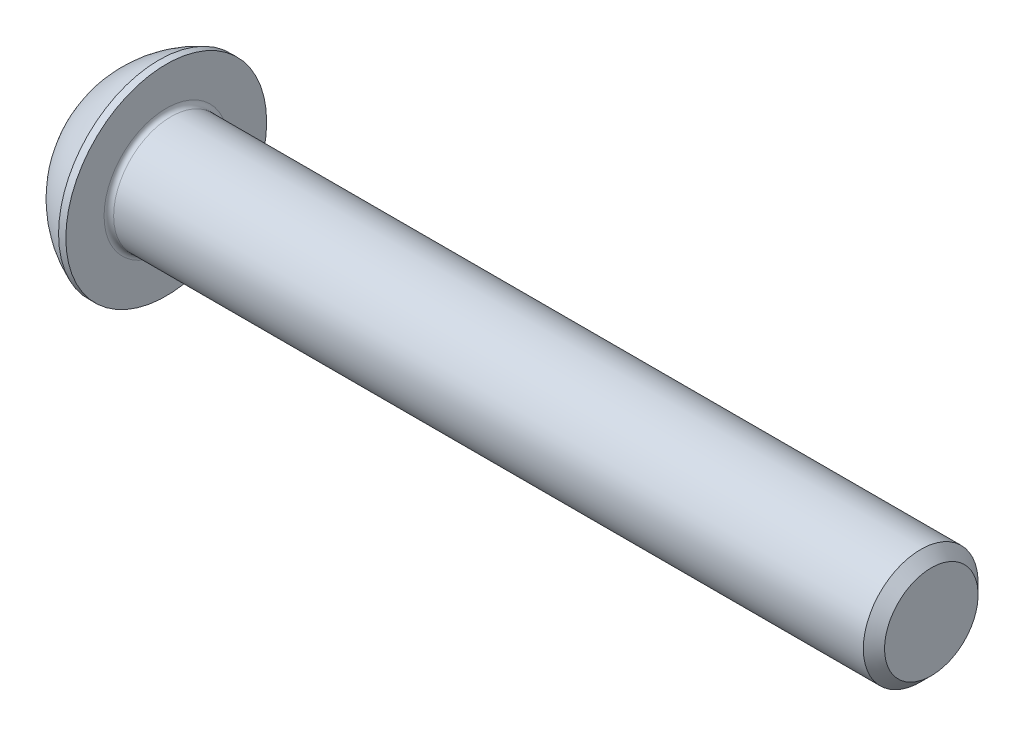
ISO-10303-21;
HEADER;
FILE_DESCRIPTION(('STEP AP214'),'2;1');
FILE_NAME('part.step','',(''),(''),'','','');
FILE_SCHEMA(('AUTOMOTIVE_DESIGN { 1 0 10303 214 1 1 1 1 }'));
ENDSEC;
DATA;
#1=APPLICATION_CONTEXT('core data for automotive mechanical design processes');
#2=APPLICATION_PROTOCOL_DEFINITION('international standard','automotive_design',2000,#1);
#3=PRODUCT_CONTEXT('',#1,'mechanical');
#4=PRODUCT('Part','Part','',(#3));
#5=PRODUCT_RELATED_PRODUCT_CATEGORY('part','',(#4));
#6=PRODUCT_DEFINITION_FORMATION('','',#4);
#7=PRODUCT_DEFINITION_CONTEXT('part definition',#1,'design');
#8=PRODUCT_DEFINITION('design','',#6,#7);
#9=PRODUCT_DEFINITION_SHAPE('','',#8);
#10=(LENGTH_UNIT() NAMED_UNIT(*) SI_UNIT(.MILLI.,.METRE.));
#11=(NAMED_UNIT(*) PLANE_ANGLE_UNIT() SI_UNIT($,.RADIAN.));
#12=(NAMED_UNIT(*) SI_UNIT($,.STERADIAN.) SOLID_ANGLE_UNIT());
#13=UNCERTAINTY_MEASURE_WITH_UNIT(LENGTH_MEASURE(1.E-05),#10,'distance_accuracy_value','');
#14=(GEOMETRIC_REPRESENTATION_CONTEXT(3) GLOBAL_UNCERTAINTY_ASSIGNED_CONTEXT((#13)) GLOBAL_UNIT_ASSIGNED_CONTEXT((#10,
#11,#12)) REPRESENTATION_CONTEXT('',''));
#15=CARTESIAN_POINT('',(0.,0.,0.));
#16=DIRECTION('',(0.,0.,1.));
#17=DIRECTION('',(1.,0.,0.));
#18=AXIS2_PLACEMENT_3D('',#15,#16,#17);
#19=CARTESIAN_POINT('',(0.,0.,0.));
#20=DIRECTION('',(-1.,0.,0.));
#21=DIRECTION('',(0.,0.,1.));
#22=AXIS2_PLACEMENT_3D('',#19,#20,#21);
#23=PLANE('',#22);
#24=CARTESIAN_POINT('',(0.,0.,0.));
#25=DIRECTION('',(-1.,0.,0.));
#26=DIRECTION('',(0.,0.,1.));
#27=AXIS2_PLACEMENT_3D('',#24,#25,#26);
#28=CIRCLE('',#27,2.625);
#29=CARTESIAN_POINT('',(0.,2.625,0.));
#30=VERTEX_POINT('',#29);
#31=EDGE_CURVE('E157',#30,#30,#28,.T.);
#32=ORIENTED_EDGE('',*,*,#31,.T.);
#33=EDGE_LOOP('',(#32));
#34=FACE_BOUND('',#33,.T.);
#35=DIRECTION('',(0.,-1.,0.));
#36=VECTOR('',#35,1.);
#37=CARTESIAN_POINT('',(0.,-1.15470053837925,2.));
#38=LINE('',#37,#36);
#39=CARTESIAN_POINT('',(0.,1.15470053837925,2.));
#40=VERTEX_POINT('',#39);
#41=CARTESIAN_POINT('',(0.,-1.15470053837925,2.));
#42=VERTEX_POINT('',#41);
#43=EDGE_CURVE('E52',#40,#42,#38,.T.);
#44=ORIENTED_EDGE('',*,*,#43,.T.);
#45=DIRECTION('',(0.,-0.5,-0.866025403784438));
#46=VECTOR('',#45,1.);
#47=CARTESIAN_POINT('',(0.,-2.3094010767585,0.));
#48=LINE('',#47,#46);
#49=CARTESIAN_POINT('',(0.,-2.3094010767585,0.));
#50=VERTEX_POINT('',#49);
#51=EDGE_CURVE('E277',#42,#50,#48,.T.);
#52=ORIENTED_EDGE('',*,*,#51,.T.);
#53=DIRECTION('',(0.,0.5,-0.866025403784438));
#54=VECTOR('',#53,1.);
#55=CARTESIAN_POINT('',(0.,-1.15470053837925,-2.));
#56=LINE('',#55,#54);
#57=CARTESIAN_POINT('',(0.,-1.15470053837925,-2.));
#58=VERTEX_POINT('',#57);
#59=EDGE_CURVE('E132',#50,#58,#56,.T.);
#60=ORIENTED_EDGE('',*,*,#59,.T.);
#61=DIRECTION('',(0.,1.,0.));
#62=VECTOR('',#61,1.);
#63=CARTESIAN_POINT('',(0.,1.15470053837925,-2.));
#64=LINE('',#63,#62);
#65=CARTESIAN_POINT('',(0.,1.15470053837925,-2.));
#66=VERTEX_POINT('',#65);
#67=EDGE_CURVE('E280',#58,#66,#64,.T.);
#68=ORIENTED_EDGE('',*,*,#67,.T.);
#69=DIRECTION('',(0.,0.5,0.866025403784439));
#70=VECTOR('',#69,1.);
#71=CARTESIAN_POINT('',(0.,2.3094010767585,0.));
#72=LINE('',#71,#70);
#73=CARTESIAN_POINT('',(0.,2.3094010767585,0.));
#74=VERTEX_POINT('',#73);
#75=EDGE_CURVE('E282',#66,#74,#72,.T.);
#76=ORIENTED_EDGE('',*,*,#75,.T.);
#77=DIRECTION('',(0.,-0.5,0.866025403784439));
#78=VECTOR('',#77,1.);
#79=CARTESIAN_POINT('',(0.,1.15470053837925,2.));
#80=LINE('',#79,#78);
#81=EDGE_CURVE('E284',#74,#40,#80,.T.);
#82=ORIENTED_EDGE('',*,*,#81,.T.);
#83=EDGE_LOOP('',(#44,#52,#60,#68,#76,#82));
#84=FACE_BOUND('',#83,.T.);
#85=ADVANCED_FACE('F37',(#34,#84),#23,.T.);
#86=CARTESIAN_POINT('',(4.99970462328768,0.,0.));
#87=DIRECTION('',(-1.,0.,0.));
#88=DIRECTION('',(0.,1.,0.));
#89=AXIS2_PLACEMENT_3D('',#86,#87,#88);
#90=SPHERICAL_SURFACE('',#89,5.64691697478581);
#91=CARTESIAN_POINT('',(2.92,0.,0.));
#92=DIRECTION('',(-1.,0.,0.));
#93=DIRECTION('',(0.,0.,1.));
#94=AXIS2_PLACEMENT_3D('',#91,#92,#93);
#95=CIRCLE('',#94,5.25);
#96=CARTESIAN_POINT('',(2.92,5.25,0.));
#97=VERTEX_POINT('',#96);
#98=EDGE_CURVE('E154',#97,#97,#95,.T.);
#99=CARTESIAN_POINT('',(2.92,5.25,0.));
#100=CARTESIAN_POINT('',(2.88116333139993,5.23461555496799,0.));
#101=CARTESIAN_POINT('',(2.84249743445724,5.21880002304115,0.));
#102=CARTESIAN_POINT('',(2.76552608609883,5.18631490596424,0.));
#103=CARTESIAN_POINT('',(2.72722063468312,5.16964532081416,0.));
#104=CARTESIAN_POINT('',(2.65098907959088,5.13546021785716,0.));
#105=CARTESIAN_POINT('',(2.61306297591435,5.11794470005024,0.));
#106=CARTESIAN_POINT('',(2.5376087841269,5.08207638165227,0.));
#107=CARTESIAN_POINT('',(2.50008069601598,5.06372358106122,0.));
#108=CARTESIAN_POINT('',(2.42544101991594,5.02618972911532,0.));
#109=CARTESIAN_POINT('',(2.38832943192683,5.00700867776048,0.));
#110=CARTESIAN_POINT('',(2.31454103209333,4.9678277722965,0.));
#111=CARTESIAN_POINT('',(2.27786422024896,4.94782791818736,0.));
#112=CARTESIAN_POINT('',(2.204963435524,4.90701925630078,0.));
#113=CARTESIAN_POINT('',(2.16873946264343,4.88621044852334,0.));
#114=CARTESIAN_POINT('',(2.09676219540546,4.84379412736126,0.));
#115=CARTESIAN_POINT('',(2.06100890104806,4.82218661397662,0.));
#116=CARTESIAN_POINT('',(1.9899905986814,4.77818352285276,0.));
#117=CARTESIAN_POINT('',(1.95472559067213,4.75578794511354,0.));
#118=CARTESIAN_POINT('',(1.88470122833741,4.7102197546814,0.));
#119=CARTESIAN_POINT('',(1.84994187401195,4.68704714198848,0.));
#120=CARTESIAN_POINT('',(1.78094593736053,4.63993629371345,0.));
#121=CARTESIAN_POINT('',(1.74670935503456,4.61599805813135,0.));
#122=CARTESIAN_POINT('',(1.67877582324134,4.56736775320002,0.));
#123=CARTESIAN_POINT('',(1.6450788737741,4.54267568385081,0.));
#124=CARTESIAN_POINT('',(1.57824120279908,4.4925498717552,0.));
#125=CARTESIAN_POINT('',(1.54510048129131,4.46711612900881,0.));
#126=CARTESIAN_POINT('',(1.4793915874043,4.4155194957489,0.));
#127=CARTESIAN_POINT('',(1.44682341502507,4.38935660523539,0.));
#128=CARTESIAN_POINT('',(1.3822756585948,4.33631456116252,0.));
#129=CARTESIAN_POINT('',(1.35029607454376,4.30943540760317,0.));
#130=CARTESIAN_POINT('',(1.28694124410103,4.2549740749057,0.));
#131=CARTESIAN_POINT('',(1.25556599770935,4.22739189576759,0.));
#132=CARTESIAN_POINT('',(1.19343529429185,4.17153809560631,0.));
#133=CARTESIAN_POINT('',(1.16267983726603,4.14326647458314,0.));
#134=CARTESIAN_POINT('',(1.10180385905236,4.0860477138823,0.));
#135=CARTESIAN_POINT('',(1.07168333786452,4.05710057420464,0.));
#136=CARTESIAN_POINT('',(1.01209206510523,3.99854503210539,0.));
#137=CARTESIAN_POINT('',(0.982621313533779,3.96893662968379,0.));
#138=CARTESIAN_POINT('',(0.924344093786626,3.90907314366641,0.));
#139=CARTESIAN_POINT('',(0.895537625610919,3.87881806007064,0.));
#140=CARTESIAN_POINT('',(0.838603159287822,3.8176761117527,0.));
#141=CARTESIAN_POINT('',(0.810475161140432,3.78678924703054,0.));
#142=CARTESIAN_POINT('',(0.754911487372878,3.72439894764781,0.));
#143=CARTESIAN_POINT('',(0.727475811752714,3.69289551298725,0.));
#144=CARTESIAN_POINT('',(0.673310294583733,3.62928758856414,0.));
#145=CARTESIAN_POINT('',(0.646580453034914,3.59718309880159,0.));
#146=CARTESIAN_POINT('',(0.593839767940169,3.53238887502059,0.));
#147=CARTESIAN_POINT('',(0.567828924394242,3.49969914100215,0.));
#148=CARTESIAN_POINT('',(0.516539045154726,3.43375052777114,0.));
#149=CARTESIAN_POINT('',(0.491260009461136,3.40049164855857,0.));
#150=CARTESIAN_POINT('',(0.441446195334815,3.33342112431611,0.));
#151=CARTESIAN_POINT('',(0.416911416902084,3.29960947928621,0.));
#152=CARTESIAN_POINT('',(0.368598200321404,3.23145007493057,0.));
#153=CARTESIAN_POINT('',(0.344819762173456,3.19710231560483,0.));
#154=CARTESIAN_POINT('',(0.298030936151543,3.12788759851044,0.));
#155=CARTESIAN_POINT('',(0.275020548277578,3.09302064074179,0.));
#156=CARTESIAN_POINT('',(0.229779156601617,3.02278469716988,0.));
#157=CARTESIAN_POINT('',(0.207548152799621,2.98741571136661,0.));
#158=CARTESIAN_POINT('',(0.163876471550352,2.91619313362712,0.));
#159=CARTESIAN_POINT('',(0.142435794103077,2.8803395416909,0.));
#160=CARTESIAN_POINT('',(0.100355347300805,2.80816539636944,0.));
#161=CARTESIAN_POINT('',(0.0797155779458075,2.7718448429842,0.));
#162=CARTESIAN_POINT('',(0.0392470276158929,2.69875470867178,0.));
#163=CARTESIAN_POINT('',(0.0194182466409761,2.66198512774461,0.));
#164=CARTESIAN_POINT('',(0.,2.625,0.));
#165=B_SPLINE_CURVE_WITH_KNOTS('',3,(#99,#100,#101,#102,#103,#104,#105,#106,#107,#108,#109,#110,
#111,#112,#113,#114,#115,#116,#117,#118,#119,#120,#121,#122,#123,#124,#125,#126,#127,#128,#129,
#130,#131,#132,#133,#134,#135,#136,#137,#138,#139,#140,#141,#142,#143,#144,#145,#146,#147,#148,
#149,#150,#151,#152,#153,#154,#155,#156,#157,#158,#159,#160,#161,#162,#163,#164),.UNSPECIFIED.,
.F.,.F.,(4,2,2,2,2,2,2,2,2,2,2,2,2,2,2,2,2,2,2,2,2,2,2,2,2,2,2,2,2,2,2,2,4),(0.,
0.12531586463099,0.25063172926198,0.37594759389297,0.50126345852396,0.62657932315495,
0.75189518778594,0.877211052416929,1.00252691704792,1.12784278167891,1.2531586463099,
1.37847451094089,1.50379037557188,1.62910624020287,1.75442210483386,1.87973796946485,
2.00505383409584,2.13036969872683,2.25568556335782,2.38100142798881,2.5063172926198,
2.63163315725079,2.75694902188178,2.88226488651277,3.00758075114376,3.13289661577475,
3.25821248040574,3.38352834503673,3.50884420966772,3.63416007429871,3.7594759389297,
3.88479180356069,4.01010766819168),.UNSPECIFIED.);
#166=EDGE_CURVE('BSEAM178',#97,#30,#165,.T.);
#167=ORIENTED_EDGE('',*,*,#98,.T.);
#168=ORIENTED_EDGE('',*,*,#31,.F.);
#169=ORIENTED_EDGE('',*,*,#166,.T.);
#170=ORIENTED_EDGE('',*,*,#166,.F.);
#171=EDGE_LOOP('',(#167,#169,#168,#170));
#172=FACE_BOUND('',#171,.T.);
#173=ADVANCED_FACE('F178',(#172),#90,.T.);
#174=CARTESIAN_POINT('',(0.,0.,0.));
#175=DIRECTION('',(-1.,0.,0.));
#176=DIRECTION('',(0.,0.,1.));
#177=AXIS2_PLACEMENT_3D('',#174,#175,#176);
#178=CYLINDRICAL_SURFACE('',#177,5.25);
#179=ORIENTED_EDGE('',*,*,#98,.F.);
#180=EDGE_LOOP('',(#179));
#181=FACE_BOUND('',#180,.T.);
#182=CARTESIAN_POINT('',(3.3,0.,0.));
#183=DIRECTION('',(-1.,0.,0.));
#184=DIRECTION('',(0.,0.,1.));
#185=AXIS2_PLACEMENT_3D('',#182,#183,#184);
#186=CIRCLE('',#185,5.25);
#187=CARTESIAN_POINT('',(3.3,0.,5.25));
#188=VERTEX_POINT('',#187);
#189=EDGE_CURVE('E151',#188,#188,#186,.T.);
#190=ORIENTED_EDGE('',*,*,#189,.T.);
#191=EDGE_LOOP('',(#190));
#192=FACE_BOUND('',#191,.T.);
#193=ADVANCED_FACE('F183',(#181,#192),#178,.T.);
#194=CARTESIAN_POINT('',(3.3,3.,0.));
#195=DIRECTION('',(-1.,0.,0.));
#196=DIRECTION('',(0.,0.,1.));
#197=AXIS2_PLACEMENT_3D('',#194,#195,#196);
#198=PLANE('',#197);
#199=CARTESIAN_POINT('',(3.3,0.,0.));
#200=DIRECTION('',(-1.,0.,0.));
#201=DIRECTION('',(0.,0.,1.));
#202=AXIS2_PLACEMENT_3D('',#199,#200,#201);
#203=CIRCLE('',#202,3.25);
#204=CARTESIAN_POINT('',(3.3,0.,3.25));
#205=VERTEX_POINT('',#204);
#206=EDGE_CURVE('E45',#205,#205,#203,.T.);
#207=ORIENTED_EDGE('',*,*,#206,.T.);
#208=EDGE_LOOP('',(#207));
#209=FACE_BOUND('',#208,.T.);
#210=ORIENTED_EDGE('',*,*,#189,.F.);
#211=EDGE_LOOP('',(#210));
#212=FACE_BOUND('',#211,.T.);
#213=ADVANCED_FACE('F162',(#209,#212),#198,.F.);
#214=CARTESIAN_POINT('',(0.,0.,0.));
#215=DIRECTION('',(-1.,0.,0.));
#216=DIRECTION('',(0.,0.,1.));
#217=AXIS2_PLACEMENT_3D('',#214,#215,#216);
#218=CYLINDRICAL_SURFACE('',#217,3.);
#219=CARTESIAN_POINT('',(3.55,0.,0.));
#220=DIRECTION('',(-1.,0.,0.));
#221=DIRECTION('',(0.,0.,1.));
#222=AXIS2_PLACEMENT_3D('',#219,#220,#221);
#223=CIRCLE('',#222,3.);
#224=CARTESIAN_POINT('',(3.55,0.,3.));
#225=VERTEX_POINT('',#224);
#226=EDGE_CURVE('E11',#225,#225,#223,.F.);
#227=ORIENTED_EDGE('',*,*,#226,.T.);
#228=EDGE_LOOP('',(#227));
#229=FACE_BOUND('',#228,.T.);
#230=CARTESIAN_POINT('',(42.7455,0.,0.));
#231=DIRECTION('',(-1.,0.,0.));
#232=DIRECTION('',(0.,0.,1.));
#233=AXIS2_PLACEMENT_3D('',#230,#231,#232);
#234=CIRCLE('',#233,3.);
#235=CARTESIAN_POINT('',(42.7455,0.,3.));
#236=VERTEX_POINT('',#235);
#237=EDGE_CURVE('E148',#236,#236,#234,.T.);
#238=ORIENTED_EDGE('',*,*,#237,.T.);
#239=EDGE_LOOP('',(#238));
#240=FACE_BOUND('',#239,.T.);
#241=ADVANCED_FACE('F192',(#229,#240),#218,.T.);
#242=CARTESIAN_POINT('',(43.3,0.,0.));
#243=DIRECTION('',(-1.,0.,0.));
#244=DIRECTION('',(0.,0.,1.));
#245=AXIS2_PLACEMENT_3D('',#242,#243,#244);
#246=CONICAL_SURFACE('',#245,2.4455,0.785398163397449);
#247=ORIENTED_EDGE('',*,*,#237,.F.);
#248=EDGE_LOOP('',(#247));
#249=FACE_BOUND('',#248,.T.);
#250=CARTESIAN_POINT('',(43.3,0.,0.));
#251=DIRECTION('',(-1.,0.,0.));
#252=DIRECTION('',(0.,0.,1.));
#253=AXIS2_PLACEMENT_3D('',#250,#251,#252);
#254=CIRCLE('',#253,2.4455);
#255=CARTESIAN_POINT('',(43.3,0.,2.4455));
#256=VERTEX_POINT('',#255);
#257=EDGE_CURVE('E144',#256,#256,#254,.T.);
#258=ORIENTED_EDGE('',*,*,#257,.T.);
#259=EDGE_LOOP('',(#258));
#260=FACE_BOUND('',#259,.T.);
#261=ADVANCED_FACE('F173',(#249,#260),#246,.T.);
#262=CARTESIAN_POINT('',(43.3,0.,0.));
#263=DIRECTION('',(-1.,0.,0.));
#264=DIRECTION('',(0.,0.,1.));
#265=AXIS2_PLACEMENT_3D('',#262,#263,#264);
#266=PLANE('',#265);
#267=ORIENTED_EDGE('',*,*,#257,.F.);
#268=EDGE_LOOP('',(#267));
#269=FACE_BOUND('',#268,.T.);
#270=ADVANCED_FACE('F166',(#269),#266,.F.);
#271=CARTESIAN_POINT('',(3.55,0.,0.));
#272=DIRECTION('',(-1.,0.,0.));
#273=DIRECTION('',(0.,0.,1.));
#274=AXIS2_PLACEMENT_3D('',#271,#272,#273);
#275=TOROIDAL_SURFACE('',#274,3.25,0.25);
#276=ORIENTED_EDGE('',*,*,#226,.F.);
#277=EDGE_LOOP('',(#276));
#278=FACE_BOUND('',#277,.T.);
#279=ORIENTED_EDGE('',*,*,#206,.F.);
#280=EDGE_LOOP('',(#279));
#281=FACE_BOUND('',#280,.T.);
#282=ADVANCED_FACE('F39',(#278,#281),#275,.F.);
#283=CARTESIAN_POINT('',(2.08,-2.3094010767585,0.));
#284=DIRECTION('',(0.,0.866025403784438,-0.500000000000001));
#285=DIRECTION('',(0.,0.500000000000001,0.866025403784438));
#286=AXIS2_PLACEMENT_3D('',#283,#284,#285);
#287=PLANE('',#286);
#288=DIRECTION('',(0.,-0.5,-0.866025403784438));
#289=VECTOR('',#288,1.);
#290=CARTESIAN_POINT('',(2.08,-2.3094010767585,0.));
#291=LINE('',#290,#289);
#292=CARTESIAN_POINT('',(2.08,-1.15470053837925,2.));
#293=VERTEX_POINT('',#292);
#294=CARTESIAN_POINT('',(2.08,-1.73205080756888,1.));
#295=VERTEX_POINT('',#294);
#296=EDGE_CURVE('E118',#293,#295,#291,.T.);
#297=ORIENTED_EDGE('',*,*,#296,.T.);
#298=CARTESIAN_POINT('',(2.08,-2.3094010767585,0.));
#299=VERTEX_POINT('',#298);
#300=EDGE_CURVE('E113',#295,#299,#291,.T.);
#301=ORIENTED_EDGE('',*,*,#300,.T.);
#302=DIRECTION('',(-1.,0.,0.));
#303=VECTOR('',#302,1.);
#304=CARTESIAN_POINT('',(2.08,-2.3094010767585,0.));
#305=LINE('',#304,#303);
#306=EDGE_CURVE('E115',#299,#50,#305,.T.);
#307=ORIENTED_EDGE('',*,*,#306,.T.);
#308=ORIENTED_EDGE('',*,*,#51,.F.);
#309=DIRECTION('',(-1.,0.,0.));
#310=VECTOR('',#309,1.);
#311=CARTESIAN_POINT('',(2.08,-1.15470053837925,2.));
#312=LINE('',#311,#310);
#313=EDGE_CURVE('E273',#293,#42,#312,.T.);
#314=ORIENTED_EDGE('',*,*,#313,.F.);
#315=EDGE_LOOP('',(#297,#301,#307,#308,#314));
#316=FACE_BOUND('',#315,.T.);
#317=ADVANCED_FACE('F114',(#316),#287,.T.);
#318=CARTESIAN_POINT('',(2.08,-1.15470053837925,-2.));
#319=DIRECTION('',(0.,0.866025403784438,0.5));
#320=DIRECTION('',(0.,-0.5,0.866025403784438));
#321=AXIS2_PLACEMENT_3D('',#318,#319,#320);
#322=PLANE('',#321);
#323=DIRECTION('',(0.,0.5,-0.866025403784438));
#324=VECTOR('',#323,1.);
#325=CARTESIAN_POINT('',(2.08,-1.15470053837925,-2.));
#326=LINE('',#325,#324);
#327=CARTESIAN_POINT('',(2.08,-1.73205080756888,-1.));
#328=VERTEX_POINT('',#327);
#329=EDGE_CURVE('E60',#299,#328,#326,.T.);
#330=ORIENTED_EDGE('',*,*,#329,.T.);
#331=CARTESIAN_POINT('',(2.08,-1.15470053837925,-2.));
#332=VERTEX_POINT('',#331);
#333=EDGE_CURVE('E127',#328,#332,#326,.T.);
#334=ORIENTED_EDGE('',*,*,#333,.T.);
#335=DIRECTION('',(-1.,0.,0.));
#336=VECTOR('',#335,1.);
#337=CARTESIAN_POINT('',(2.08,-1.15470053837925,-2.));
#338=LINE('',#337,#336);
#339=EDGE_CURVE('E134',#332,#58,#338,.T.);
#340=ORIENTED_EDGE('',*,*,#339,.T.);
#341=ORIENTED_EDGE('',*,*,#59,.F.);
#342=ORIENTED_EDGE('',*,*,#306,.F.);
#343=EDGE_LOOP('',(#330,#334,#340,#341,#342));
#344=FACE_BOUND('',#343,.T.);
#345=ADVANCED_FACE('F130',(#344),#322,.T.);
#346=CARTESIAN_POINT('',(2.08,1.15470053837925,-2.));
#347=DIRECTION('',(0.,0.,1.));
#348=DIRECTION('',(1.,0.,0.));
#349=AXIS2_PLACEMENT_3D('',#346,#347,#348);
#350=PLANE('',#349);
#351=DIRECTION('',(0.,1.,0.));
#352=VECTOR('',#351,1.);
#353=CARTESIAN_POINT('',(2.08,1.15470053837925,-2.));
#354=LINE('',#353,#352);
#355=CARTESIAN_POINT('',(2.08,0.,-2.));
#356=VERTEX_POINT('',#355);
#357=EDGE_CURVE('E254',#332,#356,#354,.T.);
#358=ORIENTED_EDGE('',*,*,#357,.T.);
#359=CARTESIAN_POINT('',(2.08,1.15470053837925,-2.));
#360=VERTEX_POINT('',#359);
#361=EDGE_CURVE('E126',#356,#360,#354,.T.);
#362=ORIENTED_EDGE('',*,*,#361,.T.);
#363=DIRECTION('',(-1.,0.,0.));
#364=VECTOR('',#363,1.);
#365=CARTESIAN_POINT('',(2.08,1.15470053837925,-2.));
#366=LINE('',#365,#364);
#367=EDGE_CURVE('E139',#360,#66,#366,.T.);
#368=ORIENTED_EDGE('',*,*,#367,.T.);
#369=ORIENTED_EDGE('',*,*,#67,.F.);
#370=ORIENTED_EDGE('',*,*,#339,.F.);
#371=EDGE_LOOP('',(#358,#362,#368,#369,#370));
#372=FACE_BOUND('',#371,.T.);
#373=ADVANCED_FACE('F206',(#372),#350,.T.);
#374=CARTESIAN_POINT('',(2.08,2.3094010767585,0.));
#375=DIRECTION('',(0.,-0.866025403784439,0.5));
#376=DIRECTION('',(0.,-0.5,-0.866025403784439));
#377=AXIS2_PLACEMENT_3D('',#374,#375,#376);
#378=PLANE('',#377);
#379=DIRECTION('',(0.,0.5,0.866025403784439));
#380=VECTOR('',#379,1.);
#381=CARTESIAN_POINT('',(2.08,2.3094010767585,0.));
#382=LINE('',#381,#380);
#383=CARTESIAN_POINT('',(2.08,1.73205080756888,-0.999999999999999));
#384=VERTEX_POINT('',#383);
#385=EDGE_CURVE('E243',#360,#384,#382,.T.);
#386=ORIENTED_EDGE('',*,*,#385,.T.);
#387=CARTESIAN_POINT('',(2.08,2.3094010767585,0.));
#388=VERTEX_POINT('',#387);
#389=EDGE_CURVE('E248',#384,#388,#382,.T.);
#390=ORIENTED_EDGE('',*,*,#389,.T.);
#391=DIRECTION('',(-1.,0.,0.));
#392=VECTOR('',#391,1.);
#393=CARTESIAN_POINT('',(2.08,2.3094010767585,0.));
#394=LINE('',#393,#392);
#395=EDGE_CURVE('E288',#388,#74,#394,.T.);
#396=ORIENTED_EDGE('',*,*,#395,.T.);
#397=ORIENTED_EDGE('',*,*,#75,.F.);
#398=ORIENTED_EDGE('',*,*,#367,.F.);
#399=EDGE_LOOP('',(#386,#390,#396,#397,#398));
#400=FACE_BOUND('',#399,.T.);
#401=ADVANCED_FACE('F209',(#400),#378,.T.);
#402=CARTESIAN_POINT('',(2.08,1.15470053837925,2.));
#403=DIRECTION('',(0.,-0.866025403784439,-0.5));
#404=DIRECTION('',(0.,0.5,-0.866025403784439));
#405=AXIS2_PLACEMENT_3D('',#402,#403,#404);
#406=PLANE('',#405);
#407=DIRECTION('',(0.,-0.5,0.866025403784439));
#408=VECTOR('',#407,1.);
#409=CARTESIAN_POINT('',(2.08,1.15470053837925,2.));
#410=LINE('',#409,#408);
#411=CARTESIAN_POINT('',(2.08,1.73205080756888,0.999999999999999));
#412=VERTEX_POINT('',#411);
#413=EDGE_CURVE('E251',#388,#412,#410,.T.);
#414=ORIENTED_EDGE('',*,*,#413,.T.);
#415=CARTESIAN_POINT('',(2.08,1.15470053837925,2.));
#416=VERTEX_POINT('',#415);
#417=EDGE_CURVE('E259',#412,#416,#410,.T.);
#418=ORIENTED_EDGE('',*,*,#417,.T.);
#419=DIRECTION('',(-1.,0.,0.));
#420=VECTOR('',#419,1.);
#421=CARTESIAN_POINT('',(2.08,1.15470053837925,2.));
#422=LINE('',#421,#420);
#423=EDGE_CURVE('E272',#416,#40,#422,.T.);
#424=ORIENTED_EDGE('',*,*,#423,.T.);
#425=ORIENTED_EDGE('',*,*,#81,.F.);
#426=ORIENTED_EDGE('',*,*,#395,.F.);
#427=EDGE_LOOP('',(#414,#418,#424,#425,#426));
#428=FACE_BOUND('',#427,.T.);
#429=ADVANCED_FACE('F213',(#428),#406,.T.);
#430=CARTESIAN_POINT('',(2.08,-1.15470053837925,2.));
#431=DIRECTION('',(0.,0.,-1.));
#432=DIRECTION('',(-1.,0.,0.));
#433=AXIS2_PLACEMENT_3D('',#430,#431,#432);
#434=PLANE('',#433);
#435=DIRECTION('',(0.,-1.,0.));
#436=VECTOR('',#435,1.);
#437=CARTESIAN_POINT('',(2.08,-1.15470053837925,2.));
#438=LINE('',#437,#436);
#439=CARTESIAN_POINT('',(2.08,0.,2.));
#440=VERTEX_POINT('',#439);
#441=EDGE_CURVE('E265',#416,#440,#438,.T.);
#442=ORIENTED_EDGE('',*,*,#441,.T.);
#443=EDGE_CURVE('E267',#440,#293,#438,.T.);
#444=ORIENTED_EDGE('',*,*,#443,.T.);
#445=ORIENTED_EDGE('',*,*,#313,.T.);
#446=ORIENTED_EDGE('',*,*,#43,.F.);
#447=ORIENTED_EDGE('',*,*,#423,.F.);
#448=EDGE_LOOP('',(#442,#444,#445,#446,#447));
#449=FACE_BOUND('',#448,.T.);
#450=ADVANCED_FACE('F217',(#449),#434,.T.);
#451=CARTESIAN_POINT('',(2.08,-2.3094010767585,0.));
#452=DIRECTION('',(1.,0.,0.));
#453=DIRECTION('',(0.,0.,-1.));
#454=AXIS2_PLACEMENT_3D('',#451,#452,#453);
#455=PLANE('',#454);
#456=CARTESIAN_POINT('',(2.08,0.,0.));
#457=DIRECTION('',(-1.,0.,0.));
#458=DIRECTION('',(0.,0.,1.));
#459=AXIS2_PLACEMENT_3D('',#456,#457,#458);
#460=CIRCLE('',#459,2.);
#461=EDGE_CURVE('E240',#384,#356,#460,.T.);
#462=ORIENTED_EDGE('',*,*,#461,.F.);
#463=ORIENTED_EDGE('',*,*,#385,.F.);
#464=ORIENTED_EDGE('',*,*,#361,.F.);
#465=EDGE_LOOP('',(#462,#463,#464));
#466=FACE_BOUND('',#465,.T.);
#467=ADVANCED_FACE('F221',(#466),#455,.F.);
#468=EDGE_CURVE('E145',#412,#384,#460,.T.);
#469=ORIENTED_EDGE('',*,*,#468,.F.);
#470=ORIENTED_EDGE('',*,*,#413,.F.);
#471=ORIENTED_EDGE('',*,*,#389,.F.);
#472=EDGE_LOOP('',(#469,#470,#471));
#473=FACE_BOUND('',#472,.T.);
#474=ADVANCED_FACE('F230',(#473),#455,.F.);
#475=EDGE_CURVE('E138',#440,#412,#460,.T.);
#476=ORIENTED_EDGE('',*,*,#475,.F.);
#477=ORIENTED_EDGE('',*,*,#441,.F.);
#478=ORIENTED_EDGE('',*,*,#417,.F.);
#479=EDGE_LOOP('',(#476,#477,#478));
#480=FACE_BOUND('',#479,.T.);
#481=ADVANCED_FACE('F235',(#480),#455,.F.);
#482=EDGE_CURVE('E133',#295,#440,#460,.T.);
#483=ORIENTED_EDGE('',*,*,#482,.F.);
#484=ORIENTED_EDGE('',*,*,#296,.F.);
#485=ORIENTED_EDGE('',*,*,#443,.F.);
#486=EDGE_LOOP('',(#483,#484,#485));
#487=FACE_BOUND('',#486,.T.);
#488=ADVANCED_FACE('F228',(#487),#455,.F.);
#489=EDGE_CURVE('E124',#328,#295,#460,.T.);
#490=ORIENTED_EDGE('',*,*,#489,.F.);
#491=ORIENTED_EDGE('',*,*,#329,.F.);
#492=ORIENTED_EDGE('',*,*,#300,.F.);
#493=EDGE_LOOP('',(#490,#491,#492));
#494=FACE_BOUND('',#493,.T.);
#495=ADVANCED_FACE('F123',(#494),#455,.F.);
#496=EDGE_CURVE('E246',#356,#328,#460,.T.);
#497=ORIENTED_EDGE('',*,*,#496,.F.);
#498=ORIENTED_EDGE('',*,*,#357,.F.);
#499=ORIENTED_EDGE('',*,*,#333,.F.);
#500=EDGE_LOOP('',(#497,#498,#499));
#501=FACE_BOUND('',#500,.T.);
#502=ADVANCED_FACE('F201',(#501),#455,.F.);
#503=CARTESIAN_POINT('',(3.23470053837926,0.,0.));
#504=DIRECTION('',(-1.,0.,0.));
#505=DIRECTION('',(0.,0.,1.));
#506=AXIS2_PLACEMENT_3D('',#503,#504,#505);
#507=CONICAL_SURFACE('',#506,0.,1.04719755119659);
#508=ORIENTED_EDGE('',*,*,#475,.T.);
#509=ORIENTED_EDGE('',*,*,#468,.T.);
#510=ORIENTED_EDGE('',*,*,#461,.T.);
#511=ORIENTED_EDGE('',*,*,#496,.T.);
#512=ORIENTED_EDGE('',*,*,#489,.T.);
#513=ORIENTED_EDGE('',*,*,#482,.T.);
#514=EDGE_LOOP('',(#508,#509,#510,#511,#512,#513));
#515=FACE_BOUND('',#514,.T.);
#516=CARTESIAN_POINT('',(3.23470053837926,0.,0.));
#517=VERTEX_POINT('',#516);
#518=VERTEX_LOOP('',#517);
#519=FACE_BOUND('',#518,.T.);
#520=ADVANCED_FACE('F199',(#515,#519),#507,.F.);
#521=CLOSED_SHELL('',(#85,#173,#193,#213,#241,#261,#270,#282,#317,#345,#373,#401,#429,#450,#467,
#474,#481,#488,#495,#502,#520));
#522=MANIFOLD_SOLID_BREP('B2',#521);
#523=ADVANCED_BREP_SHAPE_REPRESENTATION('',(#18,#522),#14);
#524=SHAPE_DEFINITION_REPRESENTATION(#9,#523);
ENDSEC;
END-ISO-10303-21;
